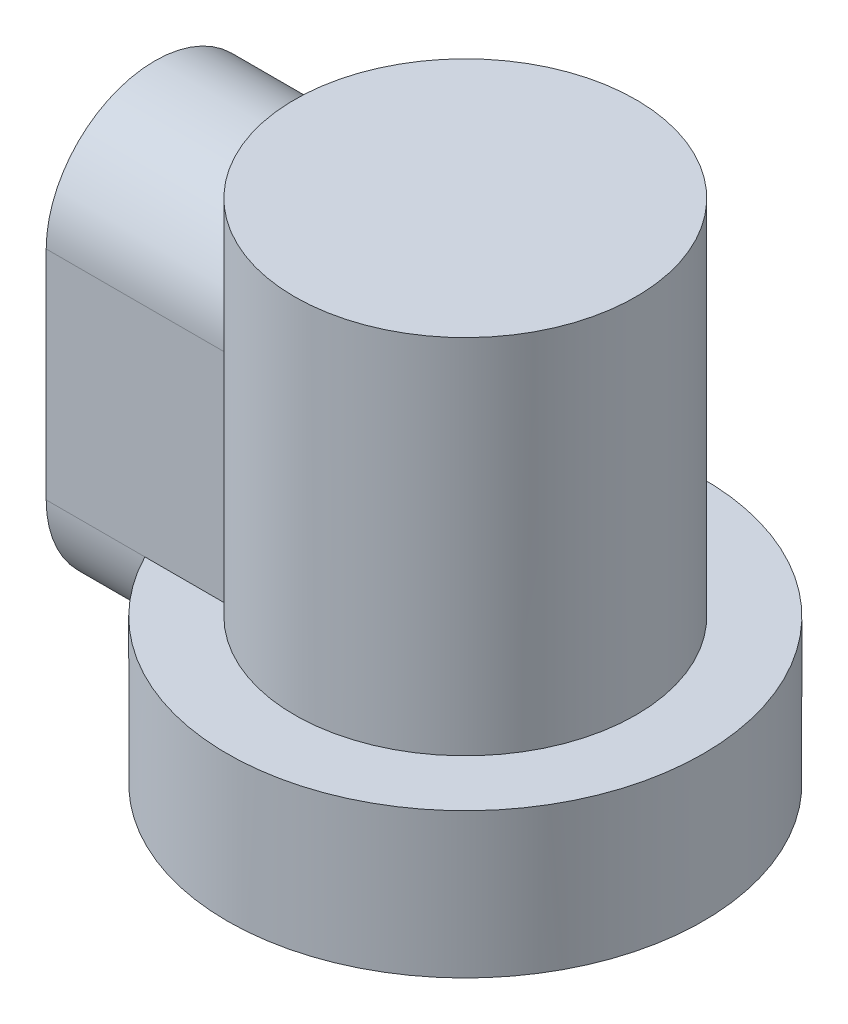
from build123d import *

# Parameters (mm, degrees)
SKETCH_1_R      = 92
EXTRUDE_1_DEPTH = 56
SKETCH_2_R      = 66
EXTRUDE_2_DEPTH = 140
EXTRUDE_3_DEPTH = 120


with BuildPart() as part:
    # Sketch 1 → Extrude 1 (new body)
    with BuildSketch(Plane(origin=(0, 0, 0), x_dir=(1, 0, 0), z_dir=(0, 1, 0))):
        with Locations(Location((0, 0, 0), (0, 0, 270))):
            Circle(SKETCH_1_R)
    extrude(amount=EXTRUDE_1_DEPTH)

    # Sketch 2 → Extrude 2 (add)
    with BuildSketch(Plane(origin=(0, 56, 0), x_dir=(1, 0, 0), z_dir=(0, 1, 0))):
        with Locations(Location((0, 0, 0), (0, 0, 270))):
            Circle(SKETCH_2_R)
    extrude(amount=EXTRUDE_2_DEPTH)

    # Sketch 3 → Extrude 3 (add)
    with BuildSketch(Plane(origin=(0, 0, 0), x_dir=(0, 0, -1), z_dir=(1, 0, 0))):
        with BuildLine():
            Line((-42, 140), (-42, 56))
            ThreePointArc((-42, 56), (0, 14), (42, 56))
            Line((42, 56), (42, 140))
            ThreePointArc((42, 140), (0, 182), (-42, 140))
        make_face()
    extrude(amount=-EXTRUDE_3_DEPTH)


solid = part.part
